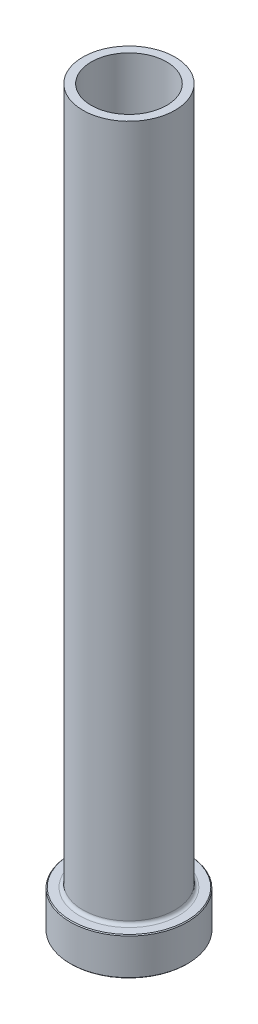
from build123d import *

# Parameters (mm, degrees)
FILLET1_R     = 0.8
CHAMFER1_SIZE = 0.2
CHAMFER3_SIZE = 0.5


with BuildPart() as part:
    # Sketch1 → Revolve1 (revolve)
    with BuildSketch(Plane.XY, mode=Mode.PRIVATE) as revolve1_sk:
        Polygon((-9, 175), (-11, 175), (-11, 9), (-14, 9), (-14, 0), (-9.25, 0), (-9.25, 108), (-9, 120), align=None)
    revolve(revolve1_sk.sketch.rotate(Axis((0, 92.187680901, 0), (0, -1, 0)), 270), axis=Axis((0, 92.187680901, 0), (0, -1, 0)))

    # Fillet1
    fillet1_edges = [part.edges().sort_by_distance(p)[0] for p in [
        (0, 9, -11),
    ]]
    fillet(fillet1_edges, radius=FILLET1_R)

    # Chamfer1
    chamfer1_edges = [part.edges().sort_by_distance(p)[0] for p in [
        (0, 0, -14),
        (0, 9, -14),
    ]]
    chamfer(chamfer1_edges, length=CHAMFER1_SIZE)

    # Chamfer3
    chamfer3_edges = [part.edges().sort_by_distance(p)[0] for p in [
        (0, 0, -9.25),
    ]]
    chamfer(chamfer3_edges, length=CHAMFER3_SIZE)


solid = part.part
